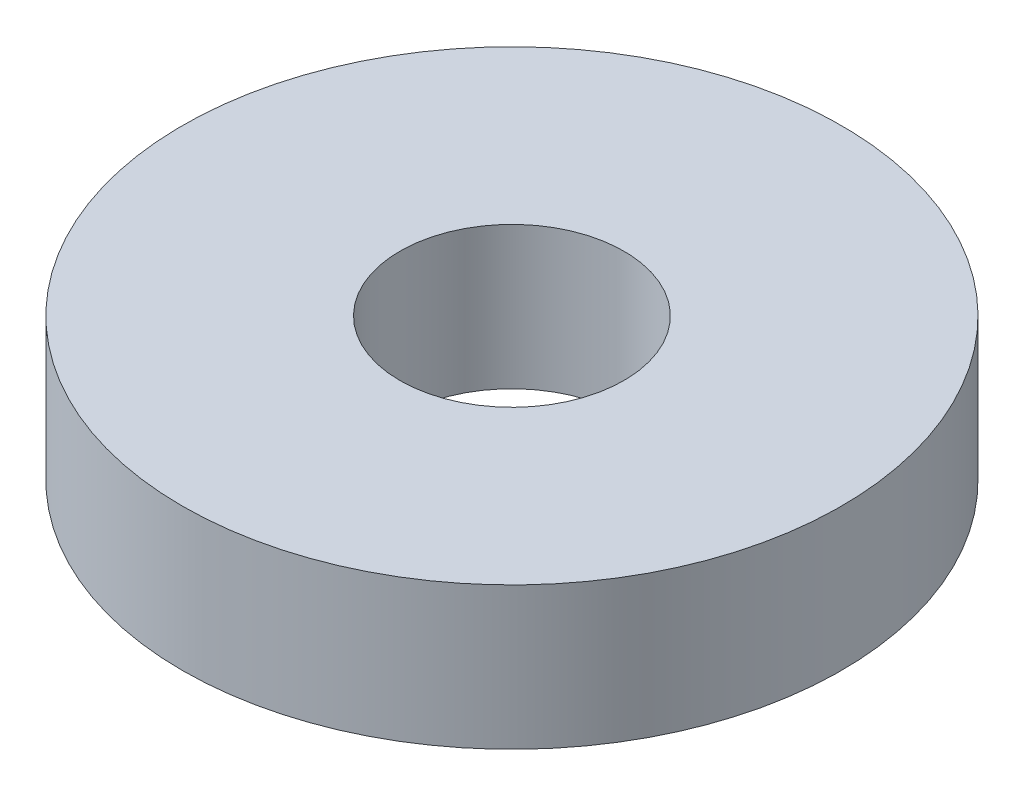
from build123d import *

# Parameters (mm, degrees)
SKETCH1_R           = 6.35
SKETCH1_R_2         = 2.159
BOSS_EXTRUDE1_DEPTH = 2.7432


with BuildPart() as part:
    # Sketch1 → Boss-Extrude1 (new body)
    with BuildSketch(Plane(origin=(0, 0, 0), x_dir=(1, 0, 0), z_dir=(0, 1, 0))):
        with Locations(Location((0, 0, 0), (0, 0, 270))):
            Circle(SKETCH1_R)
        with Locations(Location((0, 0, 0), (0, 0, 270))):
            Circle(SKETCH1_R_2, mode=Mode.SUBTRACT)
    extrude(amount=BOSS_EXTRUDE1_DEPTH)


solid = part.part
